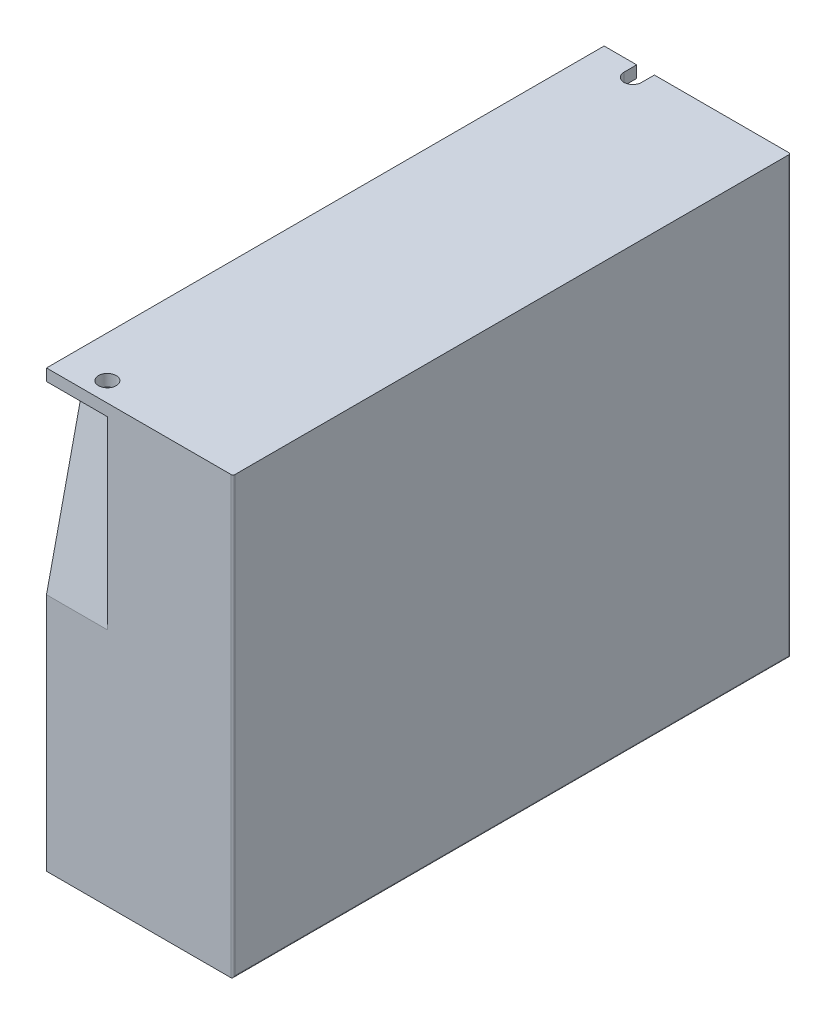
ISO-10303-21;
HEADER;
FILE_DESCRIPTION(('STEP AP214'),'2;1');
FILE_NAME('part.step','',(''),(''),'','','');
FILE_SCHEMA(('AUTOMOTIVE_DESIGN { 1 0 10303 214 1 1 1 1 }'));
ENDSEC;
DATA;
#1=APPLICATION_CONTEXT('core data for automotive mechanical design processes');
#2=APPLICATION_PROTOCOL_DEFINITION('international standard','automotive_design',2000,#1);
#3=PRODUCT_CONTEXT('',#1,'mechanical');
#4=PRODUCT('Part','Part','',(#3));
#5=PRODUCT_RELATED_PRODUCT_CATEGORY('part','',(#4));
#6=PRODUCT_DEFINITION_FORMATION('','',#4);
#7=PRODUCT_DEFINITION_CONTEXT('part definition',#1,'design');
#8=PRODUCT_DEFINITION('design','',#6,#7);
#9=PRODUCT_DEFINITION_SHAPE('','',#8);
#10=(LENGTH_UNIT() NAMED_UNIT(*) SI_UNIT(.MILLI.,.METRE.));
#11=(NAMED_UNIT(*) PLANE_ANGLE_UNIT() SI_UNIT($,.RADIAN.));
#12=(NAMED_UNIT(*) SI_UNIT($,.STERADIAN.) SOLID_ANGLE_UNIT());
#13=UNCERTAINTY_MEASURE_WITH_UNIT(LENGTH_MEASURE(1.E-05),#10,'distance_accuracy_value','');
#14=(GEOMETRIC_REPRESENTATION_CONTEXT(3) GLOBAL_UNCERTAINTY_ASSIGNED_CONTEXT((#13)) GLOBAL_UNIT_ASSIGNED_CONTEXT((#10,
#11,#12)) REPRESENTATION_CONTEXT('',''));
#15=CARTESIAN_POINT('',(0.,0.,0.));
#16=DIRECTION('',(0.,0.,1.));
#17=DIRECTION('',(1.,0.,0.));
#18=AXIS2_PLACEMENT_3D('',#15,#16,#17);
#19=CARTESIAN_POINT('',(47.5,-55.5,-71.));
#20=DIRECTION('',(0.,0.,1.));
#21=DIRECTION('',(1.,0.,0.));
#22=AXIS2_PLACEMENT_3D('',#19,#20,#21);
#23=PLANE('',#22);
#24=DIRECTION('',(-1.,0.,0.));
#25=VECTOR('',#24,1.);
#26=CARTESIAN_POINT('',(47.5,55.5,-71.));
#27=LINE('',#26,#25);
#28=CARTESIAN_POINT('',(8.3,55.5,-71.));
#29=VERTEX_POINT('',#28);
#30=CARTESIAN_POINT('',(0.,55.5,-71.));
#31=VERTEX_POINT('',#30);
#32=EDGE_CURVE('E258',#29,#31,#27,.T.);
#33=ORIENTED_EDGE('',*,*,#32,.F.);
#34=DIRECTION('',(0.,1.,0.));
#35=VECTOR('',#34,1.);
#36=CARTESIAN_POINT('',(8.3,52.5,-71.));
#37=LINE('',#36,#35);
#38=CARTESIAN_POINT('',(8.3,52.5,-71.));
#39=VERTEX_POINT('',#38);
#40=EDGE_CURVE('E184',#39,#29,#37,.T.);
#41=ORIENTED_EDGE('',*,*,#40,.F.);
#42=DIRECTION('',(-1.,0.,0.));
#43=VECTOR('',#42,1.);
#44=CARTESIAN_POINT('',(15.5,52.5,-71.));
#45=LINE('',#44,#43);
#46=CARTESIAN_POINT('',(0.,52.5,-71.));
#47=VERTEX_POINT('',#46);
#48=EDGE_CURVE('E212',#39,#47,#45,.T.);
#49=ORIENTED_EDGE('',*,*,#48,.T.);
#50=DIRECTION('',(0.,1.,0.));
#51=VECTOR('',#50,1.);
#52=CARTESIAN_POINT('',(0.,-55.5,-71.));
#53=LINE('',#52,#51);
#54=EDGE_CURVE('E232',#47,#31,#53,.T.);
#55=ORIENTED_EDGE('',*,*,#54,.T.);
#56=EDGE_LOOP('',(#33,#41,#49,#55));
#57=FACE_BOUND('',#56,.T.);
#58=ADVANCED_FACE('F35',(#57),#23,.F.);
#59=CARTESIAN_POINT('',(47.,55.5,-71.));
#60=VERTEX_POINT('',#59);
#61=CARTESIAN_POINT('',(12.8,55.5,-71.));
#62=VERTEX_POINT('',#61);
#63=EDGE_CURVE('E259',#60,#62,#27,.T.);
#64=ORIENTED_EDGE('',*,*,#63,.F.);
#65=DIRECTION('',(0.,1.,0.));
#66=VECTOR('',#65,1.);
#67=CARTESIAN_POINT('',(47.,-55.5,-71.));
#68=LINE('',#67,#66);
#69=CARTESIAN_POINT('',(47.,-55.5,-71.));
#70=VERTEX_POINT('',#69);
#71=EDGE_CURVE('E58',#60,#70,#68,.F.);
#72=ORIENTED_EDGE('',*,*,#71,.T.);
#73=DIRECTION('',(-1.,0.,0.));
#74=VECTOR('',#73,1.);
#75=CARTESIAN_POINT('',(47.5,-55.5,-71.));
#76=LINE('',#75,#74);
#77=CARTESIAN_POINT('',(0.,-55.5,-71.));
#78=VERTEX_POINT('',#77);
#79=EDGE_CURVE('E239',#70,#78,#76,.T.);
#80=ORIENTED_EDGE('',*,*,#79,.T.);
#81=CARTESIAN_POINT('',(0.,5.50000000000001,-71.));
#82=VERTEX_POINT('',#81);
#83=EDGE_CURVE('E241',#78,#82,#53,.T.);
#84=ORIENTED_EDGE('',*,*,#83,.T.);
#85=DIRECTION('',(-1.,0.,0.));
#86=VECTOR('',#85,1.);
#87=CARTESIAN_POINT('',(15.5,5.50000000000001,-71.));
#88=LINE('',#87,#86);
#89=CARTESIAN_POINT('',(15.5,5.50000000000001,-71.));
#90=VERTEX_POINT('',#89);
#91=EDGE_CURVE('E207',#90,#82,#88,.T.);
#92=ORIENTED_EDGE('',*,*,#91,.F.);
#93=DIRECTION('',(0.,-1.,0.));
#94=VECTOR('',#93,1.);
#95=CARTESIAN_POINT('',(15.5,52.5,-71.));
#96=LINE('',#95,#94);
#97=CARTESIAN_POINT('',(15.5,52.5,-71.));
#98=VERTEX_POINT('',#97);
#99=EDGE_CURVE('E200',#98,#90,#96,.T.);
#100=ORIENTED_EDGE('',*,*,#99,.F.);
#101=CARTESIAN_POINT('',(12.8,52.5,-71.));
#102=VERTEX_POINT('',#101);
#103=EDGE_CURVE('E210',#98,#102,#45,.T.);
#104=ORIENTED_EDGE('',*,*,#103,.T.);
#105=DIRECTION('',(0.,1.,0.));
#106=VECTOR('',#105,1.);
#107=CARTESIAN_POINT('',(12.8,52.5,-71.));
#108=LINE('',#107,#106);
#109=EDGE_CURVE('E160',#102,#62,#108,.T.);
#110=ORIENTED_EDGE('',*,*,#109,.T.);
#111=EDGE_LOOP('',(#64,#72,#80,#84,#92,#100,#104,#110));
#112=FACE_BOUND('',#111,.T.);
#113=ADVANCED_FACE('F318',(#112),#23,.F.);
#114=CARTESIAN_POINT('',(47.5,55.5,71.));
#115=DIRECTION('',(0.,-1.,0.));
#116=DIRECTION('',(0.,0.,-1.));
#117=AXIS2_PLACEMENT_3D('',#114,#115,#116);
#118=PLANE('',#117);
#119=CARTESIAN_POINT('',(10.55,55.5,66.05));
#120=DIRECTION('',(0.,1.,0.));
#121=DIRECTION('',(0.,0.,1.));
#122=AXIS2_PLACEMENT_3D('',#119,#120,#121);
#123=CIRCLE('',#122,2.25);
#124=CARTESIAN_POINT('',(10.55,55.5,68.3));
#125=VERTEX_POINT('',#124);
#126=EDGE_CURVE('E183',#125,#125,#123,.T.);
#127=ORIENTED_EDGE('',*,*,#126,.F.);
#128=EDGE_LOOP('',(#127));
#129=FACE_BOUND('',#128,.T.);
#130=DIRECTION('',(0.,0.,1.));
#131=VECTOR('',#130,1.);
#132=CARTESIAN_POINT('',(47.5,55.5,71.));
#133=LINE('',#132,#131);
#134=CARTESIAN_POINT('',(47.5,55.5,-70.5));
#135=VERTEX_POINT('',#134);
#136=CARTESIAN_POINT('',(47.5,55.5,70.5));
#137=VERTEX_POINT('',#136);
#138=EDGE_CURVE('E236',#135,#137,#133,.T.);
#139=ORIENTED_EDGE('',*,*,#138,.F.);
#140=CARTESIAN_POINT('',(47.,55.5,-70.5));
#141=DIRECTION('',(0.,-1.,0.));
#142=DIRECTION('',(0.,0.,-1.));
#143=AXIS2_PLACEMENT_3D('',#140,#141,#142);
#144=CIRCLE('',#143,0.5);
#145=EDGE_CURVE('E270',#135,#60,#144,.F.);
#146=ORIENTED_EDGE('',*,*,#145,.T.);
#147=ORIENTED_EDGE('',*,*,#63,.T.);
#148=DIRECTION('',(0.,0.,-1.));
#149=VECTOR('',#148,1.);
#150=CARTESIAN_POINT('',(12.8,55.5,-71.));
#151=LINE('',#150,#149);
#152=CARTESIAN_POINT('',(12.8,55.5,-67.75));
#153=VERTEX_POINT('',#152);
#154=EDGE_CURVE('E175',#153,#62,#151,.T.);
#155=ORIENTED_EDGE('',*,*,#154,.F.);
#156=CARTESIAN_POINT('',(10.55,55.5,-67.75));
#157=DIRECTION('',(0.,1.,0.));
#158=DIRECTION('',(0.,0.,1.));
#159=AXIS2_PLACEMENT_3D('',#156,#157,#158);
#160=CIRCLE('',#159,2.25);
#161=CARTESIAN_POINT('',(8.3,55.5,-67.75));
#162=VERTEX_POINT('',#161);
#163=EDGE_CURVE('E156',#162,#153,#160,.T.);
#164=ORIENTED_EDGE('',*,*,#163,.F.);
#165=DIRECTION('',(0.,0.,1.));
#166=VECTOR('',#165,1.);
#167=CARTESIAN_POINT('',(8.3,55.5,-67.75));
#168=LINE('',#167,#166);
#169=EDGE_CURVE('E172',#29,#162,#168,.T.);
#170=ORIENTED_EDGE('',*,*,#169,.F.);
#171=ORIENTED_EDGE('',*,*,#32,.T.);
#172=DIRECTION('',(0.,0.,1.));
#173=VECTOR('',#172,1.);
#174=CARTESIAN_POINT('',(0.,55.5,71.));
#175=LINE('',#174,#173);
#176=CARTESIAN_POINT('',(0.,55.5,71.));
#177=VERTEX_POINT('',#176);
#178=EDGE_CURVE('E244',#31,#177,#175,.T.);
#179=ORIENTED_EDGE('',*,*,#178,.T.);
#180=DIRECTION('',(-1.,0.,0.));
#181=VECTOR('',#180,1.);
#182=CARTESIAN_POINT('',(47.5,55.5,71.));
#183=LINE('',#182,#181);
#184=CARTESIAN_POINT('',(47.,55.5,71.));
#185=VERTEX_POINT('',#184);
#186=EDGE_CURVE('E256',#185,#177,#183,.T.);
#187=ORIENTED_EDGE('',*,*,#186,.F.);
#188=CARTESIAN_POINT('',(47.,55.5,70.5));
#189=DIRECTION('',(0.,-1.,0.));
#190=DIRECTION('',(0.,0.,-1.));
#191=AXIS2_PLACEMENT_3D('',#188,#189,#190);
#192=CIRCLE('',#191,0.5);
#193=EDGE_CURVE('E268',#185,#137,#192,.F.);
#194=ORIENTED_EDGE('',*,*,#193,.T.);
#195=EDGE_LOOP('',(#139,#146,#147,#155,#164,#170,#171,#179,#187,#194));
#196=FACE_BOUND('',#195,.T.);
#197=ADVANCED_FACE('F293',(#129,#196),#118,.F.);
#198=CARTESIAN_POINT('',(47.5,-55.5,71.));
#199=DIRECTION('',(0.,0.,-1.));
#200=DIRECTION('',(-1.,0.,0.));
#201=AXIS2_PLACEMENT_3D('',#198,#199,#200);
#202=PLANE('',#201);
#203=DIRECTION('',(-1.,0.,0.));
#204=VECTOR('',#203,1.);
#205=CARTESIAN_POINT('',(47.5,-55.5,71.));
#206=LINE('',#205,#204);
#207=CARTESIAN_POINT('',(47.,-55.5,71.));
#208=VERTEX_POINT('',#207);
#209=CARTESIAN_POINT('',(0.,-55.5,71.));
#210=VERTEX_POINT('',#209);
#211=EDGE_CURVE('E254',#208,#210,#206,.T.);
#212=ORIENTED_EDGE('',*,*,#211,.F.);
#213=DIRECTION('',(0.,-1.,0.));
#214=VECTOR('',#213,1.);
#215=CARTESIAN_POINT('',(47.,-55.5,71.));
#216=LINE('',#215,#214);
#217=EDGE_CURVE('E44',#208,#185,#216,.F.);
#218=ORIENTED_EDGE('',*,*,#217,.T.);
#219=ORIENTED_EDGE('',*,*,#186,.T.);
#220=DIRECTION('',(0.,-1.,0.));
#221=VECTOR('',#220,1.);
#222=CARTESIAN_POINT('',(0.,-55.5,71.));
#223=LINE('',#222,#221);
#224=CARTESIAN_POINT('',(0.,52.5,71.));
#225=VERTEX_POINT('',#224);
#226=EDGE_CURVE('E248',#177,#225,#223,.T.);
#227=ORIENTED_EDGE('',*,*,#226,.T.);
#228=DIRECTION('',(-1.,0.,0.));
#229=VECTOR('',#228,1.);
#230=CARTESIAN_POINT('',(15.5,52.5,71.));
#231=LINE('',#230,#229);
#232=CARTESIAN_POINT('',(15.5,52.5,71.));
#233=VERTEX_POINT('',#232);
#234=EDGE_CURVE('E225',#233,#225,#231,.T.);
#235=ORIENTED_EDGE('',*,*,#234,.F.);
#236=DIRECTION('',(0.,1.,0.));
#237=VECTOR('',#236,1.);
#238=CARTESIAN_POINT('',(15.5,52.5,71.));
#239=LINE('',#238,#237);
#240=CARTESIAN_POINT('',(15.5,5.50000000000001,71.));
#241=VERTEX_POINT('',#240);
#242=EDGE_CURVE('E215',#241,#233,#239,.T.);
#243=ORIENTED_EDGE('',*,*,#242,.F.);
#244=DIRECTION('',(-1.,0.,0.));
#245=VECTOR('',#244,1.);
#246=CARTESIAN_POINT('',(15.5,5.50000000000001,71.));
#247=LINE('',#246,#245);
#248=CARTESIAN_POINT('',(0.,5.50000000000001,71.));
#249=VERTEX_POINT('',#248);
#250=EDGE_CURVE('E229',#241,#249,#247,.T.);
#251=ORIENTED_EDGE('',*,*,#250,.T.);
#252=EDGE_CURVE('E247',#249,#210,#223,.T.);
#253=ORIENTED_EDGE('',*,*,#252,.T.);
#254=EDGE_LOOP('',(#212,#218,#219,#227,#235,#243,#251,#253));
#255=FACE_BOUND('',#254,.T.);
#256=ADVANCED_FACE('F289',(#255),#202,.F.);
#257=CARTESIAN_POINT('',(47.5,-55.5,71.));
#258=DIRECTION('',(0.,1.,0.));
#259=DIRECTION('',(0.,0.,1.));
#260=AXIS2_PLACEMENT_3D('',#257,#258,#259);
#261=PLANE('',#260);
#262=ORIENTED_EDGE('',*,*,#79,.F.);
#263=DIRECTION('',(0.,0.,-1.));
#264=VECTOR('',#263,1.);
#265=CARTESIAN_POINT('',(47.,-55.5,71.));
#266=LINE('',#265,#264);
#267=EDGE_CURVE('E11',#70,#208,#266,.F.);
#268=ORIENTED_EDGE('',*,*,#267,.T.);
#269=ORIENTED_EDGE('',*,*,#211,.T.);
#270=DIRECTION('',(0.,0.,-1.));
#271=VECTOR('',#270,1.);
#272=CARTESIAN_POINT('',(0.,-55.5,71.));
#273=LINE('',#272,#271);
#274=EDGE_CURVE('E240',#210,#78,#273,.T.);
#275=ORIENTED_EDGE('',*,*,#274,.T.);
#276=EDGE_LOOP('',(#262,#268,#269,#275));
#277=FACE_BOUND('',#276,.T.);
#278=ADVANCED_FACE('F317',(#277),#261,.F.);
#279=CARTESIAN_POINT('',(47.5,0.,0.));
#280=DIRECTION('',(-1.,0.,0.));
#281=DIRECTION('',(0.,0.,1.));
#282=AXIS2_PLACEMENT_3D('',#279,#280,#281);
#283=PLANE('',#282);
#284=DIRECTION('',(0.,0.,-1.));
#285=VECTOR('',#284,1.);
#286=CARTESIAN_POINT('',(47.5,-55.,0.));
#287=LINE('',#286,#285);
#288=CARTESIAN_POINT('',(47.5,-55.,70.5));
#289=VERTEX_POINT('',#288);
#290=CARTESIAN_POINT('',(47.5,-55.,-70.5));
#291=VERTEX_POINT('',#290);
#292=EDGE_CURVE('E261',#289,#291,#287,.T.);
#293=ORIENTED_EDGE('',*,*,#292,.T.);
#294=DIRECTION('',(0.,1.,0.));
#295=VECTOR('',#294,1.);
#296=CARTESIAN_POINT('',(47.5,0.,-70.5));
#297=LINE('',#296,#295);
#298=EDGE_CURVE('E265',#291,#135,#297,.T.);
#299=ORIENTED_EDGE('',*,*,#298,.T.);
#300=ORIENTED_EDGE('',*,*,#138,.T.);
#301=DIRECTION('',(0.,-1.,0.));
#302=VECTOR('',#301,1.);
#303=CARTESIAN_POINT('',(47.5,0.,70.5));
#304=LINE('',#303,#302);
#305=EDGE_CURVE('E263',#137,#289,#304,.T.);
#306=ORIENTED_EDGE('',*,*,#305,.T.);
#307=EDGE_LOOP('',(#293,#299,#300,#306));
#308=FACE_BOUND('',#307,.T.);
#309=ADVANCED_FACE('F407',(#308),#283,.F.);
#310=CARTESIAN_POINT('',(0.,0.,0.));
#311=DIRECTION('',(-1.,0.,0.));
#312=DIRECTION('',(0.,0.,1.));
#313=AXIS2_PLACEMENT_3D('',#310,#311,#312);
#314=PLANE('',#313);
#315=DIRECTION('',(0.,0.975942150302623,0.218029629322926));
#316=VECTOR('',#315,1.);
#317=CARTESIAN_POINT('',(0.,5.50000000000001,-71.));
#318=LINE('',#317,#316);
#319=CARTESIAN_POINT('',(0.,52.5,-60.5));
#320=VERTEX_POINT('',#319);
#321=EDGE_CURVE('E190',#82,#320,#318,.T.);
#322=ORIENTED_EDGE('',*,*,#321,.F.);
#323=ORIENTED_EDGE('',*,*,#83,.F.);
#324=ORIENTED_EDGE('',*,*,#274,.F.);
#325=ORIENTED_EDGE('',*,*,#252,.F.);
#326=DIRECTION('',(0.,-0.975942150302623,0.218029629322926));
#327=VECTOR('',#326,1.);
#328=CARTESIAN_POINT('',(0.,52.5,60.5));
#329=LINE('',#328,#327);
#330=CARTESIAN_POINT('',(0.,52.5,60.5));
#331=VERTEX_POINT('',#330);
#332=EDGE_CURVE('E219',#331,#249,#329,.T.);
#333=ORIENTED_EDGE('',*,*,#332,.F.);
#334=DIRECTION('',(0.,0.,-1.));
#335=VECTOR('',#334,1.);
#336=CARTESIAN_POINT('',(0.,52.5,71.));
#337=LINE('',#336,#335);
#338=EDGE_CURVE('E209',#225,#331,#337,.T.);
#339=ORIENTED_EDGE('',*,*,#338,.F.);
#340=ORIENTED_EDGE('',*,*,#226,.F.);
#341=ORIENTED_EDGE('',*,*,#178,.F.);
#342=ORIENTED_EDGE('',*,*,#54,.F.);
#343=DIRECTION('',(0.,0.,-1.));
#344=VECTOR('',#343,1.);
#345=CARTESIAN_POINT('',(0.,52.5,-71.));
#346=LINE('',#345,#344);
#347=EDGE_CURVE('E197',#320,#47,#346,.T.);
#348=ORIENTED_EDGE('',*,*,#347,.F.);
#349=EDGE_LOOP('',(#322,#323,#324,#325,#333,#339,#340,#341,#342,#348));
#350=FACE_BOUND('',#349,.T.);
#351=ADVANCED_FACE('F303',(#350),#314,.T.);
#352=CARTESIAN_POINT('',(15.5,52.5,60.5));
#353=DIRECTION('',(0.,-0.218029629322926,-0.975942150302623));
#354=DIRECTION('',(0.,0.975942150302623,-0.218029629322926));
#355=AXIS2_PLACEMENT_3D('',#352,#353,#354);
#356=PLANE('',#355);
#357=ORIENTED_EDGE('',*,*,#332,.T.);
#358=ORIENTED_EDGE('',*,*,#250,.F.);
#359=DIRECTION('',(0.,-0.975942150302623,0.218029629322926));
#360=VECTOR('',#359,1.);
#361=CARTESIAN_POINT('',(15.5,52.5,60.5));
#362=LINE('',#361,#360);
#363=CARTESIAN_POINT('',(15.5,52.5,60.5));
#364=VERTEX_POINT('',#363);
#365=EDGE_CURVE('E222',#364,#241,#362,.T.);
#366=ORIENTED_EDGE('',*,*,#365,.F.);
#367=DIRECTION('',(-1.,0.,0.));
#368=VECTOR('',#367,1.);
#369=CARTESIAN_POINT('',(15.5,52.5,60.5));
#370=LINE('',#369,#368);
#371=EDGE_CURVE('E233',#364,#331,#370,.T.);
#372=ORIENTED_EDGE('',*,*,#371,.T.);
#373=EDGE_LOOP('',(#357,#358,#366,#372));
#374=FACE_BOUND('',#373,.T.);
#375=ADVANCED_FACE('F313',(#374),#356,.F.);
#376=CARTESIAN_POINT('',(15.5,52.5,71.));
#377=DIRECTION('',(0.,1.,0.));
#378=DIRECTION('',(0.,0.,1.));
#379=AXIS2_PLACEMENT_3D('',#376,#377,#378);
#380=PLANE('',#379);
#381=CARTESIAN_POINT('',(10.55,52.5,66.05));
#382=DIRECTION('',(0.,1.,0.));
#383=DIRECTION('',(0.,0.,1.));
#384=AXIS2_PLACEMENT_3D('',#381,#382,#383);
#385=CIRCLE('',#384,2.25);
#386=CARTESIAN_POINT('',(10.55,52.5,68.3));
#387=VERTEX_POINT('',#386);
#388=EDGE_CURVE('E187',#387,#387,#385,.T.);
#389=ORIENTED_EDGE('',*,*,#388,.T.);
#390=EDGE_LOOP('',(#389));
#391=FACE_BOUND('',#390,.T.);
#392=ORIENTED_EDGE('',*,*,#338,.T.);
#393=ORIENTED_EDGE('',*,*,#371,.F.);
#394=DIRECTION('',(0.,0.,-1.));
#395=VECTOR('',#394,1.);
#396=CARTESIAN_POINT('',(15.5,52.5,71.));
#397=LINE('',#396,#395);
#398=EDGE_CURVE('E218',#233,#364,#397,.T.);
#399=ORIENTED_EDGE('',*,*,#398,.F.);
#400=ORIENTED_EDGE('',*,*,#234,.T.);
#401=EDGE_LOOP('',(#392,#393,#399,#400));
#402=FACE_BOUND('',#401,.T.);
#403=ADVANCED_FACE('F308',(#391,#402),#380,.F.);
#404=CARTESIAN_POINT('',(15.5,0.,0.));
#405=DIRECTION('',(1.,0.,0.));
#406=DIRECTION('',(0.,0.,-1.));
#407=AXIS2_PLACEMENT_3D('',#404,#405,#406);
#408=PLANE('',#407);
#409=ORIENTED_EDGE('',*,*,#242,.T.);
#410=ORIENTED_EDGE('',*,*,#398,.T.);
#411=ORIENTED_EDGE('',*,*,#365,.T.);
#412=EDGE_LOOP('',(#409,#410,#411));
#413=FACE_BOUND('',#412,.T.);
#414=ADVANCED_FACE('F311',(#413),#408,.F.);
#415=CARTESIAN_POINT('',(15.5,5.50000000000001,-71.));
#416=DIRECTION('',(0.,-0.218029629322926,0.975942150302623));
#417=DIRECTION('',(0.,-0.975942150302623,-0.218029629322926));
#418=AXIS2_PLACEMENT_3D('',#415,#416,#417);
#419=PLANE('',#418);
#420=ORIENTED_EDGE('',*,*,#321,.T.);
#421=DIRECTION('',(-1.,0.,0.));
#422=VECTOR('',#421,1.);
#423=CARTESIAN_POINT('',(15.5,52.5,-60.5));
#424=LINE('',#423,#422);
#425=CARTESIAN_POINT('',(15.5,52.5,-60.5));
#426=VERTEX_POINT('',#425);
#427=EDGE_CURVE('E203',#426,#320,#424,.T.);
#428=ORIENTED_EDGE('',*,*,#427,.F.);
#429=DIRECTION('',(0.,0.975942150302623,0.218029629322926));
#430=VECTOR('',#429,1.);
#431=CARTESIAN_POINT('',(15.5,5.50000000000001,-71.));
#432=LINE('',#431,#430);
#433=EDGE_CURVE('E193',#90,#426,#432,.T.);
#434=ORIENTED_EDGE('',*,*,#433,.F.);
#435=ORIENTED_EDGE('',*,*,#91,.T.);
#436=EDGE_LOOP('',(#420,#428,#434,#435));
#437=FACE_BOUND('',#436,.T.);
#438=ADVANCED_FACE('F322',(#437),#419,.F.);
#439=CARTESIAN_POINT('',(15.5,52.5,-71.));
#440=DIRECTION('',(0.,1.,0.));
#441=DIRECTION('',(0.,0.,1.));
#442=AXIS2_PLACEMENT_3D('',#439,#440,#441);
#443=PLANE('',#442);
#444=ORIENTED_EDGE('',*,*,#48,.F.);
#445=DIRECTION('',(0.,0.,1.));
#446=VECTOR('',#445,1.);
#447=CARTESIAN_POINT('',(8.3,52.5,-67.75));
#448=LINE('',#447,#446);
#449=CARTESIAN_POINT('',(8.3,52.5,-67.75));
#450=VERTEX_POINT('',#449);
#451=EDGE_CURVE('E161',#39,#450,#448,.T.);
#452=ORIENTED_EDGE('',*,*,#451,.T.);
#453=CARTESIAN_POINT('',(10.55,52.5,-67.75));
#454=DIRECTION('',(0.,1.,0.));
#455=DIRECTION('',(0.,0.,1.));
#456=AXIS2_PLACEMENT_3D('',#453,#454,#455);
#457=CIRCLE('',#456,2.25);
#458=CARTESIAN_POINT('',(12.8,52.5,-67.75));
#459=VERTEX_POINT('',#458);
#460=EDGE_CURVE('E153',#450,#459,#457,.T.);
#461=ORIENTED_EDGE('',*,*,#460,.T.);
#462=DIRECTION('',(0.,0.,-1.));
#463=VECTOR('',#462,1.);
#464=CARTESIAN_POINT('',(12.8,52.5,-71.));
#465=LINE('',#464,#463);
#466=EDGE_CURVE('E164',#459,#102,#465,.T.);
#467=ORIENTED_EDGE('',*,*,#466,.T.);
#468=ORIENTED_EDGE('',*,*,#103,.F.);
#469=DIRECTION('',(0.,0.,-1.));
#470=VECTOR('',#469,1.);
#471=CARTESIAN_POINT('',(15.5,52.5,-71.));
#472=LINE('',#471,#470);
#473=EDGE_CURVE('E196',#426,#98,#472,.T.);
#474=ORIENTED_EDGE('',*,*,#473,.F.);
#475=ORIENTED_EDGE('',*,*,#427,.T.);
#476=ORIENTED_EDGE('',*,*,#347,.T.);
#477=EDGE_LOOP('',(#444,#452,#461,#467,#468,#474,#475,#476));
#478=FACE_BOUND('',#477,.T.);
#479=ADVANCED_FACE('F171',(#478),#443,.F.);
#480=CARTESIAN_POINT('',(15.5,0.,0.));
#481=DIRECTION('',(1.,0.,0.));
#482=DIRECTION('',(0.,0.,-1.));
#483=AXIS2_PLACEMENT_3D('',#480,#481,#482);
#484=PLANE('',#483);
#485=ORIENTED_EDGE('',*,*,#433,.T.);
#486=ORIENTED_EDGE('',*,*,#473,.T.);
#487=ORIENTED_EDGE('',*,*,#99,.T.);
#488=EDGE_LOOP('',(#485,#486,#487));
#489=FACE_BOUND('',#488,.T.);
#490=ADVANCED_FACE('F326',(#489),#484,.F.);
#491=CARTESIAN_POINT('',(10.55,52.5,66.05));
#492=DIRECTION('',(0.,1.,0.));
#493=DIRECTION('',(0.,0.,1.));
#494=AXIS2_PLACEMENT_3D('',#491,#492,#493);
#495=CYLINDRICAL_SURFACE('',#494,2.25);
#496=ORIENTED_EDGE('',*,*,#388,.F.);
#497=EDGE_LOOP('',(#496));
#498=FACE_BOUND('',#497,.T.);
#499=ORIENTED_EDGE('',*,*,#126,.T.);
#500=EDGE_LOOP('',(#499));
#501=FACE_BOUND('',#500,.T.);
#502=ADVANCED_FACE('F328',(#498,#501),#495,.F.);
#503=CARTESIAN_POINT('',(10.55,52.5,-67.75));
#504=DIRECTION('',(0.,1.,0.));
#505=DIRECTION('',(0.,0.,1.));
#506=AXIS2_PLACEMENT_3D('',#503,#504,#505);
#507=CYLINDRICAL_SURFACE('',#506,2.25);
#508=ORIENTED_EDGE('',*,*,#163,.T.);
#509=DIRECTION('',(0.,1.,0.));
#510=VECTOR('',#509,1.);
#511=CARTESIAN_POINT('',(12.8,52.5,-67.75));
#512=LINE('',#511,#510);
#513=EDGE_CURVE('E149',#459,#153,#512,.T.);
#514=ORIENTED_EDGE('',*,*,#513,.F.);
#515=ORIENTED_EDGE('',*,*,#460,.F.);
#516=DIRECTION('',(0.,1.,0.));
#517=VECTOR('',#516,1.);
#518=CARTESIAN_POINT('',(8.3,52.5,-67.75));
#519=LINE('',#518,#517);
#520=EDGE_CURVE('E181',#450,#162,#519,.T.);
#521=ORIENTED_EDGE('',*,*,#520,.T.);
#522=EDGE_LOOP('',(#508,#514,#515,#521));
#523=FACE_BOUND('',#522,.T.);
#524=ADVANCED_FACE('F151',(#523),#507,.F.);
#525=CARTESIAN_POINT('',(8.3,52.5,-67.75));
#526=DIRECTION('',(-1.,0.,0.));
#527=DIRECTION('',(0.,0.,1.));
#528=AXIS2_PLACEMENT_3D('',#525,#526,#527);
#529=PLANE('',#528);
#530=ORIENTED_EDGE('',*,*,#169,.T.);
#531=ORIENTED_EDGE('',*,*,#520,.F.);
#532=ORIENTED_EDGE('',*,*,#451,.F.);
#533=ORIENTED_EDGE('',*,*,#40,.T.);
#534=EDGE_LOOP('',(#530,#531,#532,#533));
#535=FACE_BOUND('',#534,.T.);
#536=ADVANCED_FACE('F355',(#535),#529,.F.);
#537=CARTESIAN_POINT('',(12.8,52.5,-71.));
#538=DIRECTION('',(1.,0.,0.));
#539=DIRECTION('',(0.,0.,-1.));
#540=AXIS2_PLACEMENT_3D('',#537,#538,#539);
#541=PLANE('',#540);
#542=ORIENTED_EDGE('',*,*,#154,.T.);
#543=ORIENTED_EDGE('',*,*,#109,.F.);
#544=ORIENTED_EDGE('',*,*,#466,.F.);
#545=ORIENTED_EDGE('',*,*,#513,.T.);
#546=EDGE_LOOP('',(#542,#543,#544,#545));
#547=FACE_BOUND('',#546,.T.);
#548=ADVANCED_FACE('F165',(#547),#541,.F.);
#549=CARTESIAN_POINT('',(47.,0.,70.5));
#550=DIRECTION('',(0.,-1.,0.));
#551=DIRECTION('',(0.,0.,-1.));
#552=AXIS2_PLACEMENT_3D('',#549,#550,#551);
#553=CYLINDRICAL_SURFACE('',#552,0.5);
#554=ORIENTED_EDGE('',*,*,#193,.F.);
#555=ORIENTED_EDGE('',*,*,#217,.F.);
#556=CARTESIAN_POINT('',(47.,-55.,70.5));
#557=DIRECTION('',(0.,-0.707106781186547,-0.707106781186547));
#558=DIRECTION('',(0.,0.707106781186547,-0.707106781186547));
#559=AXIS2_PLACEMENT_3D('',#556,#557,#558);
#560=ELLIPSE('',#559,0.707106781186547,0.5);
#561=EDGE_CURVE('E39',#289,#208,#560,.T.);
#562=ORIENTED_EDGE('',*,*,#561,.F.);
#563=ORIENTED_EDGE('',*,*,#305,.F.);
#564=EDGE_LOOP('',(#554,#555,#562,#563));
#565=FACE_BOUND('',#564,.T.);
#566=ADVANCED_FACE('F37',(#565),#553,.T.);
#567=CARTESIAN_POINT('',(47.,-55.,0.));
#568=DIRECTION('',(0.,0.,-1.));
#569=DIRECTION('',(-1.,0.,0.));
#570=AXIS2_PLACEMENT_3D('',#567,#568,#569);
#571=CYLINDRICAL_SURFACE('',#570,0.5);
#572=ORIENTED_EDGE('',*,*,#561,.T.);
#573=ORIENTED_EDGE('',*,*,#267,.F.);
#574=CARTESIAN_POINT('',(47.,-55.,-70.5));
#575=DIRECTION('',(0.,0.707106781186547,-0.707106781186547));
#576=DIRECTION('',(0.,-0.707106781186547,-0.707106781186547));
#577=AXIS2_PLACEMENT_3D('',#574,#575,#576);
#578=ELLIPSE('',#577,0.707106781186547,0.5);
#579=EDGE_CURVE('E273',#291,#70,#578,.T.);
#580=ORIENTED_EDGE('',*,*,#579,.F.);
#581=ORIENTED_EDGE('',*,*,#292,.F.);
#582=EDGE_LOOP('',(#572,#573,#580,#581));
#583=FACE_BOUND('',#582,.T.);
#584=ADVANCED_FACE('F282',(#583),#571,.T.);
#585=CARTESIAN_POINT('',(47.,0.,-70.5));
#586=DIRECTION('',(0.,1.,0.));
#587=DIRECTION('',(0.,0.,1.));
#588=AXIS2_PLACEMENT_3D('',#585,#586,#587);
#589=CYLINDRICAL_SURFACE('',#588,0.5);
#590=ORIENTED_EDGE('',*,*,#579,.T.);
#591=ORIENTED_EDGE('',*,*,#71,.F.);
#592=ORIENTED_EDGE('',*,*,#145,.F.);
#593=ORIENTED_EDGE('',*,*,#298,.F.);
#594=EDGE_LOOP('',(#590,#591,#592,#593));
#595=FACE_BOUND('',#594,.T.);
#596=ADVANCED_FACE('F346',(#595),#589,.T.);
#597=CLOSED_SHELL('',(#58,#113,#197,#256,#278,#309,#351,#375,#403,#414,#438,#479,#490,#502,#524,
#536,#548,#566,#584,#596));
#598=MANIFOLD_SOLID_BREP('B2',#597);
#599=ADVANCED_BREP_SHAPE_REPRESENTATION('',(#18,#598),#14);
#600=SHAPE_DEFINITION_REPRESENTATION(#9,#599);
ENDSEC;
END-ISO-10303-21;
